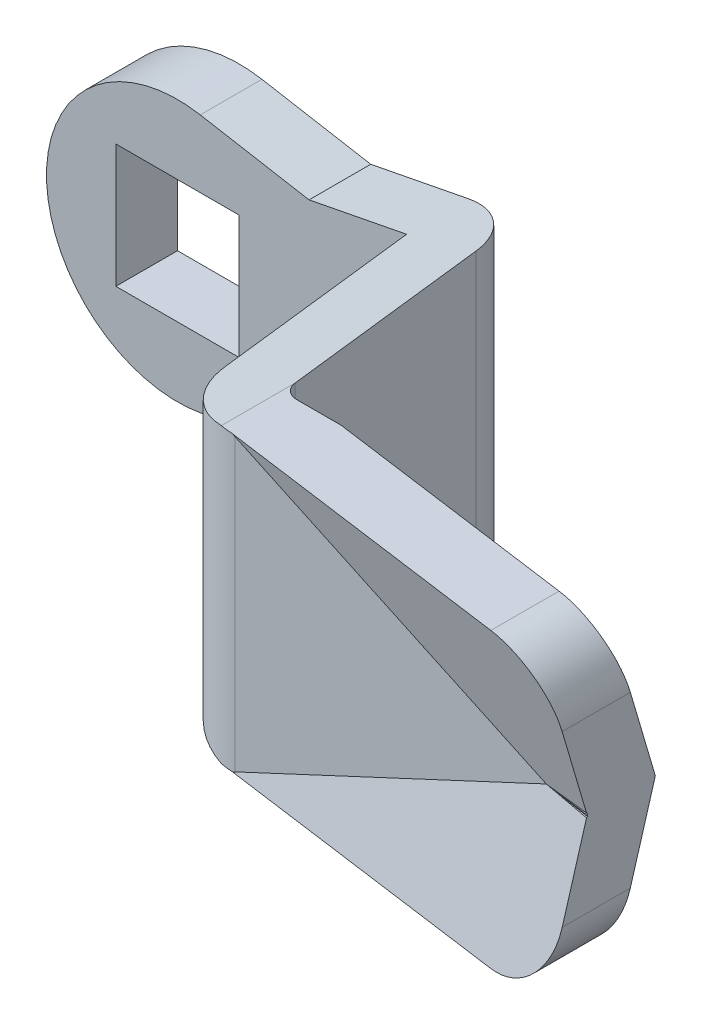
ISO-10303-21;
HEADER;
FILE_DESCRIPTION(('STEP AP214'),'2;1');
FILE_NAME('part.step','',(''),(''),'','','');
FILE_SCHEMA(('AUTOMOTIVE_DESIGN { 1 0 10303 214 1 1 1 1 }'));
ENDSEC;
DATA;
#1=APPLICATION_CONTEXT('core data for automotive mechanical design processes');
#2=APPLICATION_PROTOCOL_DEFINITION('international standard','automotive_design',2000,#1);
#3=PRODUCT_CONTEXT('',#1,'mechanical');
#4=PRODUCT('Part','Part','',(#3));
#5=PRODUCT_RELATED_PRODUCT_CATEGORY('part','',(#4));
#6=PRODUCT_DEFINITION_FORMATION('','',#4);
#7=PRODUCT_DEFINITION_CONTEXT('part definition',#1,'design');
#8=PRODUCT_DEFINITION('design','',#6,#7);
#9=PRODUCT_DEFINITION_SHAPE('','',#8);
#10=(LENGTH_UNIT() NAMED_UNIT(*) SI_UNIT(.MILLI.,.METRE.));
#11=(NAMED_UNIT(*) PLANE_ANGLE_UNIT() SI_UNIT($,.RADIAN.));
#12=(NAMED_UNIT(*) SI_UNIT($,.STERADIAN.) SOLID_ANGLE_UNIT());
#13=UNCERTAINTY_MEASURE_WITH_UNIT(LENGTH_MEASURE(1.E-05),#10,'distance_accuracy_value','');
#14=(GEOMETRIC_REPRESENTATION_CONTEXT(3) GLOBAL_UNCERTAINTY_ASSIGNED_CONTEXT((#13)) GLOBAL_UNIT_ASSIGNED_CONTEXT((#10,
#11,#12)) REPRESENTATION_CONTEXT('',''));
#15=CARTESIAN_POINT('',(0.,0.,0.));
#16=DIRECTION('',(0.,0.,1.));
#17=DIRECTION('',(1.,0.,0.));
#18=AXIS2_PLACEMENT_3D('',#15,#16,#17);
#19=CARTESIAN_POINT('',(49.9633750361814,-17.238998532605,28.1803398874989));
#20=DIRECTION('',(0.130596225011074,-0.280064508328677,-0.951056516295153));
#21=DIRECTION('',(0.,-0.959272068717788,0.282483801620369));
#22=AXIS2_PLACEMENT_3D('',#19,#20,#21);
#23=PLANE('',#22);
#24=DIRECTION('',(-0.990703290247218,0.,-0.13604040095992));
#25=VECTOR('',#24,1.);
#26=CARTESIAN_POINT('',(50.2705232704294,-9.5,25.9435575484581));
#27=LINE('',#26,#25);
#28=CARTESIAN_POINT('',(41.,-9.5,24.6705571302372));
#29=VERTEX_POINT('',#28);
#30=CARTESIAN_POINT('',(21.7800364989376,-9.5,22.0313294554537));
#31=VERTEX_POINT('',#30);
#32=EDGE_CURVE('E392',#29,#31,#27,.T.);
#33=ORIENTED_EDGE('',*,*,#32,.F.);
#34=CARTESIAN_POINT('',(41.,-5.5,23.4926481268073));
#35=DIRECTION('',(0.130596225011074,-0.280064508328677,-0.951056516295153));
#36=DIRECTION('',(0.401933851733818,-0.861949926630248,0.309016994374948));
#37=AXIS2_PLACEMENT_3D('',#34,#35,#36);
#38=ELLIPSE('',#37,4.20584889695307,4.);
#39=CARTESIAN_POINT('',(45.,-5.5,24.0419161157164));
#40=VERTEX_POINT('',#39);
#41=EDGE_CURVE('E9',#29,#40,#38,.F.);
#42=ORIENTED_EDGE('',*,*,#41,.T.);
#43=DIRECTION('',(0.,0.959272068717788,-0.28248380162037));
#44=VECTOR('',#43,1.);
#45=CARTESIAN_POINT('',(45.,-17.4236857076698,27.5531703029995));
#46=LINE('',#45,#44);
#47=CARTESIAN_POINT('',(45.,-0.136162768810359,22.4623880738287));
#48=VERTEX_POINT('',#47);
#49=EDGE_CURVE('E378',#40,#48,#46,.T.);
#50=ORIENTED_EDGE('',*,*,#49,.T.);
#51=DIRECTION('',(0.987938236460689,-0.0437421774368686,0.148541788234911));
#52=VECTOR('',#51,1.);
#53=CARTESIAN_POINT('',(51.4225647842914,-0.420529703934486,23.4280549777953));
#54=LINE('',#53,#52);
#55=CARTESIAN_POINT('',(41.924698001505,0.,22.));
#56=VERTEX_POINT('',#55);
#57=EDGE_CURVE('E224',#56,#48,#54,.T.);
#58=ORIENTED_EDGE('',*,*,#57,.F.);
#59=DIRECTION('',(0.906307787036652,0.422618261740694,0.));
#60=VECTOR('',#59,1.);
#61=CARTESIAN_POINT('',(40.8120209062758,-0.518849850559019,22.));
#62=LINE('',#61,#60);
#63=CARTESIAN_POINT('',(21.7392867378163,-9.4126118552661,22.));
#64=VERTEX_POINT('',#63);
#65=EDGE_CURVE('E451',#56,#64,#62,.F.);
#66=ORIENTED_EDGE('',*,*,#65,.T.);
#67=DIRECTION('',(-0.401933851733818,0.861949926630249,-0.309016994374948));
#68=VECTOR('',#67,1.);
#69=CARTESIAN_POINT('',(29.7779637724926,-26.651610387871,28.1803398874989));
#70=LINE('',#69,#68);
#71=EDGE_CURVE('E432',#31,#64,#70,.T.);
#72=ORIENTED_EDGE('',*,*,#71,.F.);
#73=EDGE_LOOP('',(#33,#42,#50,#58,#66,#72));
#74=FACE_BOUND('',#73,.T.);
#75=ADVANCED_FACE('F14',(#74),#23,.F.);
#76=CARTESIAN_POINT('',(45.,-40.,40.));
#77=DIRECTION('',(-1.,0.,0.));
#78=DIRECTION('',(0.,1.,0.));
#79=AXIS2_PLACEMENT_3D('',#76,#77,#78);
#80=PLANE('',#79);
#81=DIRECTION('',(0.,-0.959272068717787,-0.28248380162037));
#82=VECTOR('',#81,1.);
#83=CARTESIAN_POINT('',(45.,11.3997764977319,21.3569748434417));
#84=LINE('',#83,#82);
#85=CARTESIAN_POINT('',(45.,5.5,19.6196248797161));
#86=VERTEX_POINT('',#85);
#87=CARTESIAN_POINT('',(45.,0.,18.));
#88=VERTEX_POINT('',#87);
#89=EDGE_CURVE('E380',#86,#88,#84,.T.);
#90=ORIENTED_EDGE('',*,*,#89,.F.);
#91=DIRECTION('',(0.,0.,-1.));
#92=VECTOR('',#91,1.);
#93=CARTESIAN_POINT('',(45.,5.5,40.));
#94=LINE('',#93,#92);
#95=CARTESIAN_POINT('',(45.,5.5,24.0419161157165));
#96=VERTEX_POINT('',#95);
#97=EDGE_CURVE('E547',#86,#96,#94,.F.);
#98=ORIENTED_EDGE('',*,*,#97,.T.);
#99=DIRECTION('',(0.,0.959272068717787,0.282483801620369));
#100=VECTOR('',#99,1.);
#101=CARTESIAN_POINT('',(45.,19.9468572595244,28.2961869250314));
#102=LINE('',#101,#100);
#103=CARTESIAN_POINT('',(45.,0.13616276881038,22.4623880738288));
#104=VERTEX_POINT('',#103);
#105=EDGE_CURVE('E375',#104,#96,#102,.T.);
#106=ORIENTED_EDGE('',*,*,#105,.F.);
#107=DIRECTION('',(0.,-0.28248380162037,-0.959272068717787));
#108=VECTOR('',#107,1.);
#109=CARTESIAN_POINT('',(45.,1.6857348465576,27.7244994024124));
#110=LINE('',#109,#108);
#111=CARTESIAN_POINT('',(45.,0.114431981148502,22.3885936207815));
#112=VERTEX_POINT('',#111);
#113=EDGE_CURVE('E533',#104,#112,#110,.T.);
#114=ORIENTED_EDGE('',*,*,#113,.T.);
#115=CARTESIAN_POINT('',(45.,0.,22.4222912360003));
#116=VERTEX_POINT('',#115);
#117=EDGE_CURVE('E240',#116,#112,#46,.T.);
#118=ORIENTED_EDGE('',*,*,#117,.F.);
#119=DIRECTION('',(0.,-0.959272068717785,-0.282483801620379));
#120=VECTOR('',#119,1.);
#121=CARTESIAN_POINT('',(45.,-32.0449292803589,12.985788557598));
#122=LINE('',#121,#120);
#123=CARTESIAN_POINT('',(45.,-0.114431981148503,22.3885936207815));
#124=VERTEX_POINT('',#123);
#125=EDGE_CURVE('E232',#116,#124,#122,.T.);
#126=ORIENTED_EDGE('',*,*,#125,.T.);
#127=DIRECTION('',(0.,0.282483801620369,-0.959272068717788));
#128=VECTOR('',#127,1.);
#129=CARTESIAN_POINT('',(45.,-8.0695027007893,49.4028050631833));
#130=LINE('',#129,#128);
#131=EDGE_CURVE('E218',#48,#124,#130,.T.);
#132=ORIENTED_EDGE('',*,*,#131,.F.);
#133=ORIENTED_EDGE('',*,*,#49,.F.);
#134=DIRECTION('',(0.,0.,-1.));
#135=VECTOR('',#134,1.);
#136=CARTESIAN_POINT('',(45.,-5.5,40.));
#137=LINE('',#136,#135);
#138=CARTESIAN_POINT('',(45.,-5.5,19.6196248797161));
#139=VERTEX_POINT('',#138);
#140=EDGE_CURVE('E544',#40,#139,#137,.T.);
#141=ORIENTED_EDGE('',*,*,#140,.T.);
#142=DIRECTION('',(0.,-0.959272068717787,0.28248380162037));
#143=VECTOR('',#142,1.);
#144=CARTESIAN_POINT('',(45.,-26.2800452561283,25.7388754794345));
#145=LINE('',#144,#143);
#146=EDGE_CURVE('E382',#88,#139,#145,.T.);
#147=ORIENTED_EDGE('',*,*,#146,.F.);
#148=EDGE_LOOP('',(#90,#98,#106,#114,#118,#126,#132,#133,#141,#147));
#149=FACE_BOUND('',#148,.T.);
#150=ADVANCED_FACE('F238',(#149),#80,.F.);
#151=CARTESIAN_POINT('',(10.5,-2.8,-2.4));
#152=DIRECTION('',(1.,0.,0.));
#153=DIRECTION('',(0.,0.,1.));
#154=AXIS2_PLACEMENT_3D('',#151,#152,#153);
#155=PLANE('',#154);
#156=DIRECTION('',(0.,0.,1.));
#157=VECTOR('',#156,1.);
#158=CARTESIAN_POINT('',(10.5,-2.8,-2.4));
#159=LINE('',#158,#157);
#160=CARTESIAN_POINT('',(10.5,-2.8,-0.400000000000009));
#161=VERTEX_POINT('',#160);
#162=CARTESIAN_POINT('',(10.5,-2.8,0.));
#163=VERTEX_POINT('',#162);
#164=EDGE_CURVE('E285',#161,#163,#159,.T.);
#165=ORIENTED_EDGE('',*,*,#164,.F.);
#166=DIRECTION('',(0.,-1.,0.));
#167=VECTOR('',#166,1.);
#168=CARTESIAN_POINT('',(10.5,9.5,-0.400000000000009));
#169=LINE('',#168,#167);
#170=CARTESIAN_POINT('',(10.5,2.8,-0.400000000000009));
#171=VERTEX_POINT('',#170);
#172=EDGE_CURVE('E251',#171,#161,#169,.T.);
#173=ORIENTED_EDGE('',*,*,#172,.F.);
#174=DIRECTION('',(0.,0.,1.));
#175=VECTOR('',#174,1.);
#176=CARTESIAN_POINT('',(10.5,2.8,-2.4));
#177=LINE('',#176,#175);
#178=CARTESIAN_POINT('',(10.5,2.8,0.));
#179=VERTEX_POINT('',#178);
#180=EDGE_CURVE('E277',#171,#179,#177,.T.);
#181=ORIENTED_EDGE('',*,*,#180,.T.);
#182=DIRECTION('',(0.,1.,0.));
#183=VECTOR('',#182,1.);
#184=CARTESIAN_POINT('',(10.5,-2.8,0.));
#185=LINE('',#184,#183);
#186=EDGE_CURVE('E258',#163,#179,#185,.T.);
#187=ORIENTED_EDGE('',*,*,#186,.F.);
#188=EDGE_LOOP('',(#165,#173,#181,#187));
#189=FACE_BOUND('',#188,.T.);
#190=ADVANCED_FACE('F584',(#189),#155,.T.);
#191=CARTESIAN_POINT('',(10.5,-2.8,-2.4));
#192=DIRECTION('',(0.,1.,0.));
#193=DIRECTION('',(1.,0.,0.));
#194=AXIS2_PLACEMENT_3D('',#191,#192,#193);
#195=PLANE('',#194);
#196=DIRECTION('',(0.707106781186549,0.,0.707106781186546));
#197=VECTOR('',#196,1.);
#198=CARTESIAN_POINT('',(8.5,-2.8,-2.4));
#199=LINE('',#198,#197);
#200=CARTESIAN_POINT('',(8.5,-2.8,-2.4));
#201=VERTEX_POINT('',#200);
#202=EDGE_CURVE('E248',#201,#161,#199,.T.);
#203=ORIENTED_EDGE('',*,*,#202,.T.);
#204=ORIENTED_EDGE('',*,*,#164,.T.);
#205=DIRECTION('',(-1.,0.,0.));
#206=VECTOR('',#205,1.);
#207=CARTESIAN_POINT('',(10.5,-2.8,0.));
#208=LINE('',#207,#206);
#209=CARTESIAN_POINT('',(6.5,-2.8,0.));
#210=VERTEX_POINT('',#209);
#211=EDGE_CURVE('E266',#163,#210,#208,.T.);
#212=ORIENTED_EDGE('',*,*,#211,.T.);
#213=DIRECTION('',(0.,0.,1.));
#214=VECTOR('',#213,1.);
#215=CARTESIAN_POINT('',(6.5,-2.8,-2.4));
#216=LINE('',#215,#214);
#217=CARTESIAN_POINT('',(6.5,-2.8,-2.4));
#218=VERTEX_POINT('',#217);
#219=EDGE_CURVE('E282',#218,#210,#216,.T.);
#220=ORIENTED_EDGE('',*,*,#219,.F.);
#221=DIRECTION('',(-1.,0.,0.));
#222=VECTOR('',#221,1.);
#223=CARTESIAN_POINT('',(10.5,-2.8,-2.4));
#224=LINE('',#223,#222);
#225=EDGE_CURVE('E275',#201,#218,#224,.T.);
#226=ORIENTED_EDGE('',*,*,#225,.F.);
#227=EDGE_LOOP('',(#203,#204,#212,#220,#226));
#228=FACE_BOUND('',#227,.T.);
#229=ADVANCED_FACE('F818',(#228),#195,.F.);
#230=CARTESIAN_POINT('',(6.5,2.8,-2.4));
#231=DIRECTION('',(0.,-1.,0.));
#232=DIRECTION('',(-1.,0.,0.));
#233=AXIS2_PLACEMENT_3D('',#230,#231,#232);
#234=PLANE('',#233);
#235=DIRECTION('',(0.707106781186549,0.,0.707106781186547));
#236=VECTOR('',#235,1.);
#237=CARTESIAN_POINT('',(7.5,2.8,-3.4));
#238=LINE('',#237,#236);
#239=CARTESIAN_POINT('',(8.5,2.8,-2.4));
#240=VERTEX_POINT('',#239);
#241=EDGE_CURVE('E256',#240,#171,#238,.T.);
#242=ORIENTED_EDGE('',*,*,#241,.F.);
#243=DIRECTION('',(1.,0.,0.));
#244=VECTOR('',#243,1.);
#245=CARTESIAN_POINT('',(6.5,2.8,-2.4));
#246=LINE('',#245,#244);
#247=CARTESIAN_POINT('',(6.5,2.8,-2.4));
#248=VERTEX_POINT('',#247);
#249=EDGE_CURVE('E269',#248,#240,#246,.T.);
#250=ORIENTED_EDGE('',*,*,#249,.F.);
#251=DIRECTION('',(0.,0.,1.));
#252=VECTOR('',#251,1.);
#253=CARTESIAN_POINT('',(6.5,2.8,-2.4));
#254=LINE('',#253,#252);
#255=CARTESIAN_POINT('',(6.5,2.8,0.));
#256=VERTEX_POINT('',#255);
#257=EDGE_CURVE('E279',#248,#256,#254,.T.);
#258=ORIENTED_EDGE('',*,*,#257,.T.);
#259=DIRECTION('',(1.,0.,0.));
#260=VECTOR('',#259,1.);
#261=CARTESIAN_POINT('',(6.5,2.8,0.));
#262=LINE('',#261,#260);
#263=EDGE_CURVE('E261',#256,#179,#262,.T.);
#264=ORIENTED_EDGE('',*,*,#263,.T.);
#265=ORIENTED_EDGE('',*,*,#180,.F.);
#266=EDGE_LOOP('',(#242,#250,#258,#264,#265));
#267=FACE_BOUND('',#266,.T.);
#268=ADVANCED_FACE('F810',(#267),#234,.F.);
#269=CARTESIAN_POINT('',(10.5,2.8,-2.4));
#270=DIRECTION('',(0.,0.,-1.));
#271=DIRECTION('',(1.,0.,0.));
#272=AXIS2_PLACEMENT_3D('',#269,#270,#271);
#273=PLANE('',#272);
#274=ORIENTED_EDGE('',*,*,#249,.T.);
#275=DIRECTION('',(0.,-1.,0.));
#276=VECTOR('',#275,1.);
#277=CARTESIAN_POINT('',(8.5,9.5,-2.4));
#278=LINE('',#277,#276);
#279=EDGE_CURVE('E253',#240,#201,#278,.T.);
#280=ORIENTED_EDGE('',*,*,#279,.T.);
#281=ORIENTED_EDGE('',*,*,#225,.T.);
#282=DIRECTION('',(0.,-1.,0.));
#283=VECTOR('',#282,1.);
#284=CARTESIAN_POINT('',(6.5,2.8,-2.4));
#285=LINE('',#284,#283);
#286=EDGE_CURVE('E272',#248,#218,#285,.T.);
#287=ORIENTED_EDGE('',*,*,#286,.F.);
#288=EDGE_LOOP('',(#274,#280,#281,#287));
#289=FACE_BOUND('',#288,.T.);
#290=ADVANCED_FACE('F670',(#289),#273,.T.);
#291=CARTESIAN_POINT('',(14.8631180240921,-9.5,0.));
#292=DIRECTION('',(0.,0.,-1.));
#293=DIRECTION('',(1.,0.,0.));
#294=AXIS2_PLACEMENT_3D('',#291,#292,#293);
#295=PLANE('',#294);
#296=DIRECTION('',(0.,1.,0.));
#297=VECTOR('',#296,1.);
#298=CARTESIAN_POINT('',(14.8631180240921,-9.5,0.));
#299=LINE('',#298,#297);
#300=CARTESIAN_POINT('',(14.8631180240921,-8.35589681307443,0.));
#301=VERTEX_POINT('',#300);
#302=CARTESIAN_POINT('',(14.8631180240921,8.35589681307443,0.));
#303=VERTEX_POINT('',#302);
#304=EDGE_CURVE('E479',#301,#303,#299,.T.);
#305=ORIENTED_EDGE('',*,*,#304,.F.);
#306=DIRECTION('',(-0.981627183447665,0.190808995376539,0.));
#307=VECTOR('',#306,1.);
#308=CARTESIAN_POINT('',(15.0774123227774,-8.39755140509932,0.));
#309=LINE('',#308,#307);
#310=CARTESIAN_POINT('',(8.53591755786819,-7.12601363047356,0.));
#311=VERTEX_POINT('',#310);
#312=EDGE_CURVE('E325',#301,#311,#309,.T.);
#313=ORIENTED_EDGE('',*,*,#312,.T.);
#314=DIRECTION('',(0.984807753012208,0.173648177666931,0.));
#315=VECTOR('',#314,1.);
#316=CARTESIAN_POINT('',(14.2663540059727,-6.11558307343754,0.));
#317=LINE('',#316,#315);
#318=CARTESIAN_POINT('',(1.47600951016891,-8.37086590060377,0.));
#319=VERTEX_POINT('',#318);
#320=EDGE_CURVE('E531',#319,#311,#317,.T.);
#321=ORIENTED_EDGE('',*,*,#320,.F.);
#322=CARTESIAN_POINT('',(0.,0.,0.));
#323=DIRECTION('',(0.,0.,-1.));
#324=DIRECTION('',(1.,0.,0.));
#325=AXIS2_PLACEMENT_3D('',#322,#323,#324);
#326=CIRCLE('',#325,8.5);
#327=CARTESIAN_POINT('',(1.47600951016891,8.37086590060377,0.));
#328=VERTEX_POINT('',#327);
#329=EDGE_CURVE('E334',#319,#328,#326,.T.);
#330=ORIENTED_EDGE('',*,*,#329,.T.);
#331=DIRECTION('',(0.984807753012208,-0.173648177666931,0.));
#332=VECTOR('',#331,1.);
#333=CARTESIAN_POINT('',(17.5155453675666,5.54266297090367,0.));
#334=LINE('',#333,#332);
#335=CARTESIAN_POINT('',(8.53591755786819,7.12601363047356,0.));
#336=VERTEX_POINT('',#335);
#337=EDGE_CURVE('E534',#328,#336,#334,.T.);
#338=ORIENTED_EDGE('',*,*,#337,.T.);
#339=DIRECTION('',(-0.981627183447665,-0.190808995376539,0.));
#340=VECTOR('',#339,1.);
#341=CARTESIAN_POINT('',(11.5186496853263,7.70579802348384,0.));
#342=LINE('',#341,#340);
#343=EDGE_CURVE('E308',#303,#336,#342,.T.);
#344=ORIENTED_EDGE('',*,*,#343,.F.);
#345=EDGE_LOOP('',(#305,#313,#321,#330,#338,#344));
#346=FACE_BOUND('',#345,.T.);
#347=DIRECTION('',(1.,0.,0.));
#348=VECTOR('',#347,1.);
#349=CARTESIAN_POINT('',(-4.,4.,0.));
#350=LINE('',#349,#348);
#351=CARTESIAN_POINT('',(-4.,4.,0.));
#352=VERTEX_POINT('',#351);
#353=CARTESIAN_POINT('',(4.,4.,0.));
#354=VERTEX_POINT('',#353);
#355=EDGE_CURVE('E352',#352,#354,#350,.T.);
#356=ORIENTED_EDGE('',*,*,#355,.F.);
#357=DIRECTION('',(0.,-1.,0.));
#358=VECTOR('',#357,1.);
#359=CARTESIAN_POINT('',(-4.,4.,0.));
#360=LINE('',#359,#358);
#361=CARTESIAN_POINT('',(-4.,-4.,0.));
#362=VERTEX_POINT('',#361);
#363=EDGE_CURVE('E343',#352,#362,#360,.T.);
#364=ORIENTED_EDGE('',*,*,#363,.T.);
#365=DIRECTION('',(-1.,0.,0.));
#366=VECTOR('',#365,1.);
#367=CARTESIAN_POINT('',(4.,-4.,0.));
#368=LINE('',#367,#366);
#369=CARTESIAN_POINT('',(4.,-4.,0.));
#370=VERTEX_POINT('',#369);
#371=EDGE_CURVE('E346',#370,#362,#368,.T.);
#372=ORIENTED_EDGE('',*,*,#371,.F.);
#373=DIRECTION('',(0.,1.,0.));
#374=VECTOR('',#373,1.);
#375=CARTESIAN_POINT('',(4.,-4.,0.));
#376=LINE('',#375,#374);
#377=EDGE_CURVE('E349',#370,#354,#376,.T.);
#378=ORIENTED_EDGE('',*,*,#377,.T.);
#379=EDGE_LOOP('',(#356,#364,#372,#378));
#380=FACE_BOUND('',#379,.T.);
#381=ORIENTED_EDGE('',*,*,#211,.F.);
#382=ORIENTED_EDGE('',*,*,#186,.T.);
#383=ORIENTED_EDGE('',*,*,#263,.F.);
#384=DIRECTION('',(0.,-1.,0.));
#385=VECTOR('',#384,1.);
#386=CARTESIAN_POINT('',(6.5,2.8,0.));
#387=LINE('',#386,#385);
#388=EDGE_CURVE('E264',#256,#210,#387,.T.);
#389=ORIENTED_EDGE('',*,*,#388,.T.);
#390=EDGE_LOOP('',(#381,#382,#383,#389));
#391=FACE_BOUND('',#390,.T.);
#392=ADVANCED_FACE('F616',(#346,#380,#391),#295,.T.);
#393=CARTESIAN_POINT('',(14.8631180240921,-9.5,4.));
#394=DIRECTION('',(0.,0.,-1.));
#395=DIRECTION('',(1.,0.,0.));
#396=AXIS2_PLACEMENT_3D('',#393,#394,#395);
#397=PLANE('',#396);
#398=DIRECTION('',(0.,-1.,0.));
#399=VECTOR('',#398,1.);
#400=CARTESIAN_POINT('',(-4.,-9.5,4.));
#401=LINE('',#400,#399);
#402=CARTESIAN_POINT('',(-4.,4.,4.));
#403=VERTEX_POINT('',#402);
#404=CARTESIAN_POINT('',(-4.,-4.,4.));
#405=VERTEX_POINT('',#404);
#406=EDGE_CURVE('E373',#403,#405,#401,.T.);
#407=ORIENTED_EDGE('',*,*,#406,.F.);
#408=DIRECTION('',(1.,0.,0.));
#409=VECTOR('',#408,1.);
#410=CARTESIAN_POINT('',(14.8631180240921,4.,4.));
#411=LINE('',#410,#409);
#412=CARTESIAN_POINT('',(4.,4.,4.));
#413=VERTEX_POINT('',#412);
#414=EDGE_CURVE('E364',#403,#413,#411,.T.);
#415=ORIENTED_EDGE('',*,*,#414,.T.);
#416=DIRECTION('',(0.,1.,0.));
#417=VECTOR('',#416,1.);
#418=CARTESIAN_POINT('',(4.,-9.5,4.));
#419=LINE('',#418,#417);
#420=CARTESIAN_POINT('',(4.,-4.,4.));
#421=VERTEX_POINT('',#420);
#422=EDGE_CURVE('E367',#421,#413,#419,.T.);
#423=ORIENTED_EDGE('',*,*,#422,.F.);
#424=DIRECTION('',(-1.,0.,0.));
#425=VECTOR('',#424,1.);
#426=CARTESIAN_POINT('',(14.8631180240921,-4.,4.));
#427=LINE('',#426,#425);
#428=EDGE_CURVE('E370',#421,#405,#427,.T.);
#429=ORIENTED_EDGE('',*,*,#428,.T.);
#430=EDGE_LOOP('',(#407,#415,#423,#429));
#431=FACE_BOUND('',#430,.T.);
#432=DIRECTION('',(-0.981627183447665,0.190808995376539,0.));
#433=VECTOR('',#432,1.);
#434=CARTESIAN_POINT('',(15.0774123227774,-8.39755140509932,4.));
#435=LINE('',#434,#433);
#436=CARTESIAN_POINT('',(14.8631180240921,-8.35589681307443,4.));
#437=VERTEX_POINT('',#436);
#438=CARTESIAN_POINT('',(8.53591755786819,-7.12601363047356,4.));
#439=VERTEX_POINT('',#438);
#440=EDGE_CURVE('E332',#437,#439,#435,.T.);
#441=ORIENTED_EDGE('',*,*,#440,.F.);
#442=DIRECTION('',(0.,1.,0.));
#443=VECTOR('',#442,1.);
#444=CARTESIAN_POINT('',(14.8631180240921,-9.5,4.));
#445=LINE('',#444,#443);
#446=CARTESIAN_POINT('',(14.8631180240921,8.35589681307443,4.));
#447=VERTEX_POINT('',#446);
#448=EDGE_CURVE('E482',#437,#447,#445,.T.);
#449=ORIENTED_EDGE('',*,*,#448,.T.);
#450=DIRECTION('',(-0.981627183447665,-0.190808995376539,0.));
#451=VECTOR('',#450,1.);
#452=CARTESIAN_POINT('',(11.5186496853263,7.70579802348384,4.));
#453=LINE('',#452,#451);
#454=CARTESIAN_POINT('',(8.53591755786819,7.12601363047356,4.));
#455=VERTEX_POINT('',#454);
#456=EDGE_CURVE('E316',#447,#455,#453,.T.);
#457=ORIENTED_EDGE('',*,*,#456,.T.);
#458=DIRECTION('',(0.984807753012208,-0.173648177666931,0.));
#459=VECTOR('',#458,1.);
#460=CARTESIAN_POINT('',(17.5155453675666,5.54266297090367,4.));
#461=LINE('',#460,#459);
#462=CARTESIAN_POINT('',(1.47600951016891,8.37086590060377,4.));
#463=VERTEX_POINT('',#462);
#464=EDGE_CURVE('E338',#463,#455,#461,.T.);
#465=ORIENTED_EDGE('',*,*,#464,.F.);
#466=CARTESIAN_POINT('',(0.,0.,4.));
#467=DIRECTION('',(0.,0.,-1.));
#468=DIRECTION('',(1.,0.,0.));
#469=AXIS2_PLACEMENT_3D('',#466,#467,#468);
#470=CIRCLE('',#469,8.5);
#471=CARTESIAN_POINT('',(1.47600951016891,-8.37086590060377,4.));
#472=VERTEX_POINT('',#471);
#473=EDGE_CURVE('E336',#472,#463,#470,.T.);
#474=ORIENTED_EDGE('',*,*,#473,.F.);
#475=DIRECTION('',(0.984807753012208,0.173648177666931,0.));
#476=VECTOR('',#475,1.);
#477=CARTESIAN_POINT('',(14.2663540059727,-6.11558307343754,4.));
#478=LINE('',#477,#476);
#479=EDGE_CURVE('E340',#472,#439,#478,.T.);
#480=ORIENTED_EDGE('',*,*,#479,.T.);
#481=EDGE_LOOP('',(#441,#449,#457,#465,#474,#480));
#482=FACE_BOUND('',#481,.T.);
#483=ADVANCED_FACE('F521',(#431,#482),#397,.F.);
#484=CARTESIAN_POINT('',(21.7392867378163,-9.5,17.));
#485=DIRECTION('',(0.,1.,0.));
#486=DIRECTION('',(1.,0.,0.));
#487=AXIS2_PLACEMENT_3D('',#484,#485,#486);
#488=CYLINDRICAL_SURFACE('',#487,5.);
#489=CARTESIAN_POINT('',(21.7392867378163,-9.69248861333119,17.));
#490=DIRECTION('',(-0.190808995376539,-0.981627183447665,0.));
#491=DIRECTION('',(-0.981627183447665,0.190808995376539,0.));
#492=AXIS2_PLACEMENT_3D('',#489,#490,#491);
#493=ELLIPSE('',#492,5.09358347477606,5.);
#494=CARTESIAN_POINT('',(20.7490186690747,-9.5,21.9009559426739));
#495=VERTEX_POINT('',#494);
#496=CARTESIAN_POINT('',(16.7879463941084,-8.73004554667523,17.6958655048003));
#497=VERTEX_POINT('',#496);
#498=EDGE_CURVE('E330',#495,#497,#493,.T.);
#499=ORIENTED_EDGE('',*,*,#498,.F.);
#500=CARTESIAN_POINT('',(21.7392867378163,-9.5,17.));
#501=DIRECTION('',(0.,-1.,0.));
#502=DIRECTION('',(-1.,0.,0.));
#503=AXIS2_PLACEMENT_3D('',#500,#501,#502);
#504=CIRCLE('',#503,5.);
#505=CARTESIAN_POINT('',(21.5545081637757,-9.5,21.9965845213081));
#506=VERTEX_POINT('',#505);
#507=EDGE_CURVE('E467',#506,#495,#504,.T.);
#508=ORIENTED_EDGE('',*,*,#507,.F.);
#509=CARTESIAN_POINT('',(21.7392867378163,-11.205157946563,17.));
#510=DIRECTION('',(-0.401933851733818,0.861949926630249,-0.309016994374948));
#511=DIRECTION('',(0.683336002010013,0.506993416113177,0.52536614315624));
#512=AXIS2_PLACEMENT_3D('',#509,#510,#511);
#513=ELLIPSE('',#512,5.80080100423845,5.);
#514=EDGE_CURVE('E448',#64,#506,#513,.F.);
#515=ORIENTED_EDGE('',*,*,#514,.F.);
#516=DIRECTION('',(0.,1.,0.));
#517=VECTOR('',#516,1.);
#518=CARTESIAN_POINT('',(21.7392867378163,-9.5,22.));
#519=LINE('',#518,#517);
#520=CARTESIAN_POINT('',(21.7392867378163,9.4126118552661,22.));
#521=VERTEX_POINT('',#520);
#522=EDGE_CURVE('E416',#64,#521,#519,.T.);
#523=ORIENTED_EDGE('',*,*,#522,.T.);
#524=CARTESIAN_POINT('',(21.7392867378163,11.205157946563,17.));
#525=DIRECTION('',(-0.401933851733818,-0.861949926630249,-0.309016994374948));
#526=DIRECTION('',(-0.683336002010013,0.506993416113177,-0.52536614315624));
#527=AXIS2_PLACEMENT_3D('',#524,#525,#526);
#528=ELLIPSE('',#527,5.80080100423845,5.);
#529=CARTESIAN_POINT('',(21.5545081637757,9.5,21.9965845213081));
#530=VERTEX_POINT('',#529);
#531=EDGE_CURVE('E442',#521,#530,#528,.T.);
#532=ORIENTED_EDGE('',*,*,#531,.T.);
#533=CARTESIAN_POINT('',(21.7392867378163,9.5,17.));
#534=DIRECTION('',(0.,-1.,0.));
#535=DIRECTION('',(-1.,0.,0.));
#536=AXIS2_PLACEMENT_3D('',#533,#534,#535);
#537=CIRCLE('',#536,5.);
#538=CARTESIAN_POINT('',(20.7490186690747,9.5,21.9009559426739));
#539=VERTEX_POINT('',#538);
#540=EDGE_CURVE('E459',#530,#539,#537,.T.);
#541=ORIENTED_EDGE('',*,*,#540,.T.);
#542=CARTESIAN_POINT('',(21.7392867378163,9.69248861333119,17.));
#543=DIRECTION('',(0.190808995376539,-0.981627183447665,0.));
#544=DIRECTION('',(0.981627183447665,0.190808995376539,0.));
#545=AXIS2_PLACEMENT_3D('',#542,#543,#544);
#546=ELLIPSE('',#545,5.09358347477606,5.);
#547=CARTESIAN_POINT('',(16.7879463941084,8.73004554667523,17.6958655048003));
#548=VERTEX_POINT('',#547);
#549=EDGE_CURVE('E313',#539,#548,#546,.T.);
#550=ORIENTED_EDGE('',*,*,#549,.T.);
#551=DIRECTION('',(0.,1.,0.));
#552=VECTOR('',#551,1.);
#553=CARTESIAN_POINT('',(16.7879463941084,-9.5,17.6958655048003));
#554=LINE('',#553,#552);
#555=EDGE_CURVE('E484',#497,#548,#554,.T.);
#556=ORIENTED_EDGE('',*,*,#555,.F.);
#557=EDGE_LOOP('',(#499,#508,#515,#523,#532,#541,#550,#556));
#558=FACE_BOUND('',#557,.T.);
#559=ADVANCED_FACE('F494',(#558),#488,.T.);
#560=CARTESIAN_POINT('',(21.7392867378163,-9.5,17.));
#561=DIRECTION('',(0.,-1.,0.));
#562=DIRECTION('',(-1.,0.,0.));
#563=AXIS2_PLACEMENT_3D('',#560,#561,#562);
#564=PLANE('',#563);
#565=DIRECTION('',(0.990703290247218,0.,0.13604040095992));
#566=VECTOR('',#565,1.);
#567=CARTESIAN_POINT('',(33.3500490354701,-9.5,19.1977975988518));
#568=LINE('',#567,#566);
#569=CARTESIAN_POINT('',(24.6271842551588,-9.5,18.));
#570=VERTEX_POINT('',#569);
#571=CARTESIAN_POINT('',(41.,-9.5,20.2482658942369));
#572=VERTEX_POINT('',#571);
#573=EDGE_CURVE('E415',#570,#572,#568,.T.);
#574=ORIENTED_EDGE('',*,*,#573,.T.);
#575=DIRECTION('',(0.,0.,-1.));
#576=VECTOR('',#575,1.);
#577=CARTESIAN_POINT('',(41.,-9.5,40.));
#578=LINE('',#577,#576);
#579=EDGE_CURVE('E22',#572,#29,#578,.F.);
#580=ORIENTED_EDGE('',*,*,#579,.T.);
#581=ORIENTED_EDGE('',*,*,#32,.T.);
#582=CARTESIAN_POINT('',(21.7800364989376,-9.5,22.0313294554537));
#583=CARTESIAN_POINT('',(21.7423539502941,-9.50000000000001,22.0261519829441));
#584=CARTESIAN_POINT('',(21.7047186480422,-9.50000000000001,22.0206678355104));
#585=CARTESIAN_POINT('',(21.6295425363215,-9.50000000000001,22.0090861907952));
#586=CARTESIAN_POINT('',(21.5920017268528,-9.50000000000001,22.0029886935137));
#587=CARTESIAN_POINT('',(21.5545081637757,-9.5,21.9965845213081));
#588=B_SPLINE_CURVE_WITH_KNOTS('',3,(#582,#583,#584,#585,#586,#587),.UNSPECIFIED.,.F.,.F.,(4,2,
4),(0.,0.114098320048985,0.228196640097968),.UNSPECIFIED.);
#589=EDGE_CURVE('E384',#31,#506,#588,.T.);
#590=ORIENTED_EDGE('',*,*,#589,.T.);
#591=ORIENTED_EDGE('',*,*,#507,.T.);
#592=DIRECTION('',(0.,0.,-1.));
#593=VECTOR('',#592,1.);
#594=CARTESIAN_POINT('',(20.7490186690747,-9.5,25.));
#595=LINE('',#594,#593);
#596=CARTESIAN_POINT('',(20.7490186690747,-9.5,17.1391731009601));
#597=VERTEX_POINT('',#596);
#598=EDGE_CURVE('E301',#495,#597,#595,.T.);
#599=ORIENTED_EDGE('',*,*,#598,.T.);
#600=CARTESIAN_POINT('',(21.7392867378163,-9.5,17.));
#601=DIRECTION('',(0.,-1.,0.));
#602=DIRECTION('',(-1.,0.,0.));
#603=AXIS2_PLACEMENT_3D('',#600,#601,#602);
#604=CIRCLE('',#603,1.);
#605=CARTESIAN_POINT('',(21.7392867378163,-9.5,18.));
#606=VERTEX_POINT('',#605);
#607=EDGE_CURVE('E464',#606,#597,#604,.T.);
#608=ORIENTED_EDGE('',*,*,#607,.F.);
#609=DIRECTION('',(-1.,0.,0.));
#610=VECTOR('',#609,1.);
#611=CARTESIAN_POINT('',(45.,-9.5,18.));
#612=LINE('',#611,#610);
#613=EDGE_CURVE('E462',#570,#606,#612,.T.);
#614=ORIENTED_EDGE('',*,*,#613,.F.);
#615=EDGE_LOOP('',(#574,#580,#581,#590,#591,#599,#608,#614));
#616=FACE_BOUND('',#615,.T.);
#617=ADVANCED_FACE('F561',(#616),#564,.T.);
#618=CARTESIAN_POINT('',(16.7879463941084,-9.5,17.6958655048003));
#619=DIRECTION('',(0.990268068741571,0.,-0.139173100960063));
#620=DIRECTION('',(0.139173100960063,0.,0.990268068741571));
#621=AXIS2_PLACEMENT_3D('',#618,#619,#620);
#622=PLANE('',#621);
#623=DIRECTION('',(-0.139122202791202,0.0270426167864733,-0.989905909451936));
#624=VECTOR('',#623,1.);
#625=CARTESIAN_POINT('',(16.7908431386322,-8.73060861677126,17.7164769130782));
#626=LINE('',#625,#624);
#627=EDGE_CURVE('E328',#497,#437,#626,.T.);
#628=ORIENTED_EDGE('',*,*,#627,.F.);
#629=ORIENTED_EDGE('',*,*,#555,.T.);
#630=DIRECTION('',(-0.139122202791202,-0.0270426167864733,-0.989905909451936));
#631=VECTOR('',#630,1.);
#632=CARTESIAN_POINT('',(16.7193607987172,8.71671385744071,17.2078536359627));
#633=LINE('',#632,#631);
#634=EDGE_CURVE('E310',#548,#447,#633,.T.);
#635=ORIENTED_EDGE('',*,*,#634,.T.);
#636=ORIENTED_EDGE('',*,*,#448,.F.);
#637=EDGE_LOOP('',(#628,#629,#635,#636));
#638=FACE_BOUND('',#637,.T.);
#639=ADVANCED_FACE('F518',(#638),#622,.F.);
#640=CARTESIAN_POINT('',(14.8631180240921,-9.5,4.));
#641=DIRECTION('',(0.,1.,0.));
#642=DIRECTION('',(1.,0.,0.));
#643=AXIS2_PLACEMENT_3D('',#640,#641,#642);
#644=CYLINDRICAL_SURFACE('',#643,4.);
#645=DIRECTION('',(0.,1.,0.));
#646=VECTOR('',#645,1.);
#647=CARTESIAN_POINT('',(18.8241902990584,-9.5,3.44330759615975));
#648=LINE('',#647,#646);
#649=CARTESIAN_POINT('',(18.8241902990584,-9.1258512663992,3.44330759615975));
#650=VERTEX_POINT('',#649);
#651=CARTESIAN_POINT('',(18.8241902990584,9.12585126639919,3.44330759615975));
#652=VERTEX_POINT('',#651);
#653=EDGE_CURVE('E476',#650,#652,#648,.T.);
#654=ORIENTED_EDGE('',*,*,#653,.F.);
#655=CARTESIAN_POINT('',(14.8631180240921,-8.35589681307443,4.));
#656=DIRECTION('',(-0.190808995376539,-0.981627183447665,0.));
#657=DIRECTION('',(-0.981627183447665,0.190808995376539,0.));
#658=AXIS2_PLACEMENT_3D('',#655,#656,#657);
#659=ELLIPSE('',#658,4.07486677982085,4.);
#660=EDGE_CURVE('E322',#650,#301,#659,.F.);
#661=ORIENTED_EDGE('',*,*,#660,.T.);
#662=ORIENTED_EDGE('',*,*,#304,.T.);
#663=CARTESIAN_POINT('',(14.8631180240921,8.35589681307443,4.));
#664=DIRECTION('',(0.190808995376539,-0.981627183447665,0.));
#665=DIRECTION('',(0.981627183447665,0.190808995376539,0.));
#666=AXIS2_PLACEMENT_3D('',#663,#664,#665);
#667=ELLIPSE('',#666,4.07486677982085,4.);
#668=EDGE_CURVE('E306',#652,#303,#667,.F.);
#669=ORIENTED_EDGE('',*,*,#668,.F.);
#670=EDGE_LOOP('',(#654,#661,#662,#669));
#671=FACE_BOUND('',#670,.T.);
#672=ADVANCED_FACE('F595',(#671),#644,.T.);
#673=CARTESIAN_POINT('',(20.7490186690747,-9.5,17.1391731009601));
#674=DIRECTION('',(0.990268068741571,0.,-0.139173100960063));
#675=DIRECTION('',(0.139173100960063,0.,0.990268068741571));
#676=AXIS2_PLACEMENT_3D('',#673,#674,#675);
#677=PLANE('',#676);
#678=DIRECTION('',(0.,1.,0.));
#679=VECTOR('',#678,1.);
#680=CARTESIAN_POINT('',(20.7490186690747,-9.5,17.1391731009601));
#681=LINE('',#680,#679);
#682=CARTESIAN_POINT('',(20.7490186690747,9.5,17.1391731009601));
#683=VERTEX_POINT('',#682);
#684=EDGE_CURVE('E473',#597,#683,#681,.T.);
#685=ORIENTED_EDGE('',*,*,#684,.F.);
#686=DIRECTION('',(-0.139122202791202,0.0270426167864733,-0.989905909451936));
#687=VECTOR('',#686,1.);
#688=CARTESIAN_POINT('',(20.7490186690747,-9.5,17.1391731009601));
#689=LINE('',#688,#687);
#690=EDGE_CURVE('E319',#597,#650,#689,.T.);
#691=ORIENTED_EDGE('',*,*,#690,.T.);
#692=ORIENTED_EDGE('',*,*,#653,.T.);
#693=DIRECTION('',(-0.139122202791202,-0.0270426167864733,-0.989905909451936));
#694=VECTOR('',#693,1.);
#695=CARTESIAN_POINT('',(20.6775363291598,9.48610524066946,16.6305498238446));
#696=LINE('',#695,#694);
#697=EDGE_CURVE('E304',#683,#652,#696,.T.);
#698=ORIENTED_EDGE('',*,*,#697,.F.);
#699=EDGE_LOOP('',(#685,#691,#692,#698));
#700=FACE_BOUND('',#699,.T.);
#701=ADVANCED_FACE('F587',(#700),#677,.T.);
#702=DIRECTION('',(0.991435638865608,0.0368913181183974,0.125277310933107));
#703=VECTOR('',#702,1.);
#704=CARTESIAN_POINT('',(41.924698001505,0.,22.));
#705=LINE('',#704,#703);
#706=EDGE_CURVE('E245',#56,#112,#705,.T.);
#707=ORIENTED_EDGE('',*,*,#706,.F.);
#708=DIRECTION('',(0.990703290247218,0.,0.136040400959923));
#709=VECTOR('',#708,1.);
#710=CARTESIAN_POINT('',(50.6475627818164,0.,23.1977975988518));
#711=LINE('',#710,#709);
#712=EDGE_CURVE('E228',#56,#116,#711,.T.);
#713=ORIENTED_EDGE('',*,*,#712,.T.);
#714=ORIENTED_EDGE('',*,*,#117,.T.);
#715=EDGE_LOOP('',(#707,#713,#714));
#716=FACE_BOUND('',#715,.T.);
#717=ADVANCED_FACE('F579',(#716),#23,.F.);
#718=CARTESIAN_POINT('',(29.7779637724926,-28.444156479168,23.1803398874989));
#719=DIRECTION('',(0.401933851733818,-0.861949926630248,0.309016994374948));
#720=DIRECTION('',(0.683336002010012,0.506993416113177,0.52536614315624));
#721=AXIS2_PLACEMENT_3D('',#718,#719,#720);
#722=ELLIPSE('',#721,5.80080100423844,5.);
#723=DIRECTION('',(-0.401933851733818,0.861949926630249,-0.309016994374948));
#724=VECTOR('',#723,1.);
#725=SURFACE_OF_LINEAR_EXTRUSION('',#722,#724);
#726=ORIENTED_EDGE('',*,*,#589,.F.);
#727=ORIENTED_EDGE('',*,*,#71,.T.);
#728=ORIENTED_EDGE('',*,*,#514,.T.);
#729=EDGE_LOOP('',(#726,#727,#728));
#730=FACE_BOUND('',#729,.T.);
#731=ADVANCED_FACE('F394',(#730),#725,.F.);
#732=CARTESIAN_POINT('',(32.6658612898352,-26.738998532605,24.1803398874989));
#733=DIRECTION('',(-0.130596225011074,0.280064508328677,0.951056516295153));
#734=DIRECTION('',(0.,0.959272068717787,-0.28248380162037));
#735=AXIS2_PLACEMENT_3D('',#732,#733,#734);
#736=PLANE('',#735);
#737=ORIENTED_EDGE('',*,*,#146,.T.);
#738=CARTESIAN_POINT('',(41.,-5.5,19.070356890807));
#739=DIRECTION('',(-0.130596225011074,0.280064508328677,0.951056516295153));
#740=DIRECTION('',(0.401933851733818,-0.861949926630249,0.309016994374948));
#741=AXIS2_PLACEMENT_3D('',#738,#739,#740);
#742=ELLIPSE('',#741,4.20584889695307,4.);
#743=EDGE_CURVE('E36',#139,#572,#742,.F.);
#744=ORIENTED_EDGE('',*,*,#743,.T.);
#745=ORIENTED_EDGE('',*,*,#573,.F.);
#746=DIRECTION('',(-0.906307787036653,-0.422618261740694,0.));
#747=VECTOR('',#746,1.);
#748=CARTESIAN_POINT('',(45.,0.,18.));
#749=LINE('',#748,#747);
#750=EDGE_CURVE('E439',#88,#570,#749,.T.);
#751=ORIENTED_EDGE('',*,*,#750,.F.);
#752=EDGE_LOOP('',(#737,#744,#745,#751));
#753=FACE_BOUND('',#752,.T.);
#754=ADVANCED_FACE('F594',(#753),#736,.F.);
#755=CARTESIAN_POINT('',(45.,-9.5,18.));
#756=DIRECTION('',(0.,0.,-1.));
#757=DIRECTION('',(0.,-1.,0.));
#758=AXIS2_PLACEMENT_3D('',#755,#756,#757);
#759=PLANE('',#758);
#760=DIRECTION('',(-0.906307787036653,0.422618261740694,0.));
#761=VECTOR('',#760,1.);
#762=CARTESIAN_POINT('',(45.,0.,18.));
#763=LINE('',#762,#761);
#764=CARTESIAN_POINT('',(24.6271842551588,9.5,18.));
#765=VERTEX_POINT('',#764);
#766=EDGE_CURVE('E436',#88,#765,#763,.T.);
#767=ORIENTED_EDGE('',*,*,#766,.F.);
#768=ORIENTED_EDGE('',*,*,#750,.T.);
#769=ORIENTED_EDGE('',*,*,#613,.T.);
#770=DIRECTION('',(0.,1.,0.));
#771=VECTOR('',#770,1.);
#772=CARTESIAN_POINT('',(21.7392867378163,-9.5,18.));
#773=LINE('',#772,#771);
#774=CARTESIAN_POINT('',(21.7392867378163,9.5,18.));
#775=VERTEX_POINT('',#774);
#776=EDGE_CURVE('E470',#606,#775,#773,.T.);
#777=ORIENTED_EDGE('',*,*,#776,.T.);
#778=DIRECTION('',(-1.,0.,0.));
#779=VECTOR('',#778,1.);
#780=CARTESIAN_POINT('',(45.,9.5,18.));
#781=LINE('',#780,#779);
#782=EDGE_CURVE('E454',#765,#775,#781,.T.);
#783=ORIENTED_EDGE('',*,*,#782,.F.);
#784=EDGE_LOOP('',(#767,#768,#769,#777,#783));
#785=FACE_BOUND('',#784,.T.);
#786=ADVANCED_FACE('F604',(#785),#759,.T.);
#787=CARTESIAN_POINT('',(45.,-9.5,22.));
#788=DIRECTION('',(0.,0.,-1.));
#789=DIRECTION('',(0.,-1.,0.));
#790=AXIS2_PLACEMENT_3D('',#787,#788,#789);
#791=PLANE('',#790);
#792=ORIENTED_EDGE('',*,*,#65,.F.);
#793=DIRECTION('',(-0.906307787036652,0.422618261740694,0.));
#794=VECTOR('',#793,1.);
#795=CARTESIAN_POINT('',(48.089443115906,-2.87466785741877,22.));
#796=LINE('',#795,#794);
#797=EDGE_CURVE('E445',#56,#521,#796,.T.);
#798=ORIENTED_EDGE('',*,*,#797,.T.);
#799=ORIENTED_EDGE('',*,*,#522,.F.);
#800=EDGE_LOOP('',(#792,#798,#799));
#801=FACE_BOUND('',#800,.T.);
#802=ADVANCED_FACE('F16',(#801),#791,.F.);
#803=CARTESIAN_POINT('',(21.7392867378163,-9.5,17.));
#804=DIRECTION('',(0.,1.,0.));
#805=DIRECTION('',(1.,0.,0.));
#806=AXIS2_PLACEMENT_3D('',#803,#804,#805);
#807=CYLINDRICAL_SURFACE('',#806,1.);
#808=ORIENTED_EDGE('',*,*,#776,.F.);
#809=ORIENTED_EDGE('',*,*,#607,.T.);
#810=ORIENTED_EDGE('',*,*,#684,.T.);
#811=CARTESIAN_POINT('',(21.7392867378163,9.5,17.));
#812=DIRECTION('',(0.,-1.,0.));
#813=DIRECTION('',(-1.,0.,0.));
#814=AXIS2_PLACEMENT_3D('',#811,#812,#813);
#815=CIRCLE('',#814,1.);
#816=EDGE_CURVE('E456',#775,#683,#815,.T.);
#817=ORIENTED_EDGE('',*,*,#816,.F.);
#818=EDGE_LOOP('',(#808,#809,#810,#817));
#819=FACE_BOUND('',#818,.T.);
#820=ADVANCED_FACE('F608',(#819),#807,.F.);
#821=CARTESIAN_POINT('',(21.7392867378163,9.5,17.));
#822=DIRECTION('',(0.,-1.,0.));
#823=DIRECTION('',(-1.,0.,0.));
#824=AXIS2_PLACEMENT_3D('',#821,#822,#823);
#825=PLANE('',#824);
#826=DIRECTION('',(-0.990703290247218,0.,-0.13604040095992));
#827=VECTOR('',#826,1.);
#828=CARTESIAN_POINT('',(27.40568055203,9.5,22.8038260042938));
#829=LINE('',#828,#827);
#830=CARTESIAN_POINT('',(41.,9.5,24.6705571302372));
#831=VERTEX_POINT('',#830);
#832=CARTESIAN_POINT('',(21.7800364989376,9.5,22.0313294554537));
#833=VERTEX_POINT('',#832);
#834=EDGE_CURVE('E430',#831,#833,#829,.T.);
#835=ORIENTED_EDGE('',*,*,#834,.F.);
#836=DIRECTION('',(0.,0.,-1.));
#837=VECTOR('',#836,1.);
#838=CARTESIAN_POINT('',(41.,9.5,17.));
#839=LINE('',#838,#837);
#840=CARTESIAN_POINT('',(41.,9.5,20.2482658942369));
#841=VERTEX_POINT('',#840);
#842=EDGE_CURVE('E540',#831,#841,#839,.T.);
#843=ORIENTED_EDGE('',*,*,#842,.T.);
#844=DIRECTION('',(0.990703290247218,0.,0.13604040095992));
#845=VECTOR('',#844,1.);
#846=CARTESIAN_POINT('',(50.2928225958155,9.5,21.5243283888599));
#847=LINE('',#846,#845);
#848=EDGE_CURVE('E556',#765,#841,#847,.T.);
#849=ORIENTED_EDGE('',*,*,#848,.F.);
#850=ORIENTED_EDGE('',*,*,#782,.T.);
#851=ORIENTED_EDGE('',*,*,#816,.T.);
#852=DIRECTION('',(0.,0.,-1.));
#853=VECTOR('',#852,1.);
#854=CARTESIAN_POINT('',(20.7490186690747,9.5,25.));
#855=LINE('',#854,#853);
#856=EDGE_CURVE('E287',#539,#683,#855,.T.);
#857=ORIENTED_EDGE('',*,*,#856,.F.);
#858=ORIENTED_EDGE('',*,*,#540,.F.);
#859=CARTESIAN_POINT('',(21.7800364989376,9.5,22.0313294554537));
#860=CARTESIAN_POINT('',(21.7423539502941,9.5,22.0261519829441));
#861=CARTESIAN_POINT('',(21.7047186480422,9.5,22.0206678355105));
#862=CARTESIAN_POINT('',(21.6295425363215,9.5,22.0090861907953));
#863=CARTESIAN_POINT('',(21.5920017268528,9.5,22.0029886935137));
#864=CARTESIAN_POINT('',(21.5545081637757,9.5,21.9965845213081));
#865=B_SPLINE_CURVE_WITH_KNOTS('',3,(#859,#860,#861,#862,#863,#864),.UNSPECIFIED.,.F.,.F.,(4,2,
4),(0.,0.114098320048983,0.228196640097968),.UNSPECIFIED.);
#866=EDGE_CURVE('E408',#833,#530,#865,.T.);
#867=ORIENTED_EDGE('',*,*,#866,.F.);
#868=EDGE_LOOP('',(#835,#843,#849,#850,#851,#857,#858,#867));
#869=FACE_BOUND('',#868,.T.);
#870=ADVANCED_FACE('F509',(#869),#825,.F.);
#871=CARTESIAN_POINT('',(26.9644268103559,20.6179609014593,26.0172209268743));
#872=DIRECTION('',(0.130596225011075,0.280064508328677,-0.951056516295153));
#873=DIRECTION('',(0.,-0.959272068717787,-0.282483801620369));
#874=AXIS2_PLACEMENT_3D('',#871,#872,#873);
#875=PLANE('',#874);
#876=ORIENTED_EDGE('',*,*,#105,.T.);
#877=CARTESIAN_POINT('',(41.,5.5,23.4926481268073));
#878=DIRECTION('',(0.130596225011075,0.280064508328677,-0.951056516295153));
#879=DIRECTION('',(-0.401933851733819,-0.861949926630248,-0.309016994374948));
#880=AXIS2_PLACEMENT_3D('',#877,#878,#879);
#881=ELLIPSE('',#880,4.20584889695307,4.);
#882=EDGE_CURVE('E549',#96,#831,#881,.F.);
#883=ORIENTED_EDGE('',*,*,#882,.T.);
#884=ORIENTED_EDGE('',*,*,#834,.T.);
#885=DIRECTION('',(-0.401933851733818,-0.861949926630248,-0.309016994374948));
#886=VECTOR('',#885,1.);
#887=CARTESIAN_POINT('',(26.9644268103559,20.6179609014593,26.0172209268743));
#888=LINE('',#887,#886);
#889=EDGE_CURVE('E431',#833,#521,#888,.T.);
#890=ORIENTED_EDGE('',*,*,#889,.T.);
#891=ORIENTED_EDGE('',*,*,#797,.F.);
#892=DIRECTION('',(-0.987938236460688,-0.0437421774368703,-0.148541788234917));
#893=VECTOR('',#892,1.);
#894=CARTESIAN_POINT('',(42.0457266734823,0.00535869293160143,22.018197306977));
#895=LINE('',#894,#893);
#896=EDGE_CURVE('E503',#104,#56,#895,.T.);
#897=ORIENTED_EDGE('',*,*,#896,.F.);
#898=EDGE_LOOP('',(#876,#883,#884,#890,#891,#897));
#899=FACE_BOUND('',#898,.T.);
#900=ADVANCED_FACE('F405',(#899),#875,.F.);
#901=CARTESIAN_POINT('',(50.2251400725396,11.2053490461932,22.0172209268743));
#902=DIRECTION('',(-0.130596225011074,-0.280064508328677,0.951056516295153));
#903=DIRECTION('',(0.,0.959272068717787,0.28248380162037));
#904=AXIS2_PLACEMENT_3D('',#901,#902,#903);
#905=PLANE('',#904);
#906=ORIENTED_EDGE('',*,*,#848,.T.);
#907=CARTESIAN_POINT('',(41.,5.5,19.070356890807));
#908=DIRECTION('',(-0.130596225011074,-0.280064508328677,0.951056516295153));
#909=DIRECTION('',(-0.401933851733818,-0.861949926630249,-0.309016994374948));
#910=AXIS2_PLACEMENT_3D('',#907,#908,#909);
#911=ELLIPSE('',#910,4.20584889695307,4.);
#912=EDGE_CURVE('E542',#841,#86,#911,.F.);
#913=ORIENTED_EDGE('',*,*,#912,.T.);
#914=ORIENTED_EDGE('',*,*,#89,.T.);
#915=ORIENTED_EDGE('',*,*,#766,.T.);
#916=EDGE_LOOP('',(#906,#913,#914,#915));
#917=FACE_BOUND('',#916,.T.);
#918=ADVANCED_FACE('F425',(#917),#905,.F.);
#919=CARTESIAN_POINT('',(26.9644268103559,22.4105069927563,21.0172209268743));
#920=DIRECTION('',(0.401933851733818,0.861949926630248,0.309016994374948));
#921=DIRECTION('',(-0.683336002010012,0.506993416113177,-0.525366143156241));
#922=AXIS2_PLACEMENT_3D('',#919,#920,#921);
#923=ELLIPSE('',#922,5.80080100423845,5.);
#924=DIRECTION('',(-0.401933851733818,-0.861949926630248,-0.309016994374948));
#925=VECTOR('',#924,1.);
#926=SURFACE_OF_LINEAR_EXTRUSION('',#923,#925);
#927=ORIENTED_EDGE('',*,*,#889,.F.);
#928=ORIENTED_EDGE('',*,*,#866,.T.);
#929=ORIENTED_EDGE('',*,*,#531,.F.);
#930=EDGE_LOOP('',(#927,#928,#929));
#931=FACE_BOUND('',#930,.T.);
#932=ADVANCED_FACE('F419',(#931),#926,.F.);
#933=CARTESIAN_POINT('',(-4.,4.,25.2198251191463));
#934=DIRECTION('',(1.,0.,0.));
#935=DIRECTION('',(0.,0.,1.));
#936=AXIS2_PLACEMENT_3D('',#933,#934,#935);
#937=PLANE('',#936);
#938=ORIENTED_EDGE('',*,*,#406,.T.);
#939=DIRECTION('',(0.,0.,-1.));
#940=VECTOR('',#939,1.);
#941=CARTESIAN_POINT('',(-4.,-4.,25.2198251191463));
#942=LINE('',#941,#940);
#943=EDGE_CURVE('E362',#405,#362,#942,.T.);
#944=ORIENTED_EDGE('',*,*,#943,.T.);
#945=ORIENTED_EDGE('',*,*,#363,.F.);
#946=DIRECTION('',(0.,0.,-1.));
#947=VECTOR('',#946,1.);
#948=CARTESIAN_POINT('',(-4.,4.,25.2198251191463));
#949=LINE('',#948,#947);
#950=EDGE_CURVE('E355',#403,#352,#949,.T.);
#951=ORIENTED_EDGE('',*,*,#950,.F.);
#952=EDGE_LOOP('',(#938,#944,#945,#951));
#953=FACE_BOUND('',#952,.T.);
#954=ADVANCED_FACE('F424',(#953),#937,.T.);
#955=CARTESIAN_POINT('',(4.,-4.,25.2198251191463));
#956=DIRECTION('',(0.,-1.,0.));
#957=DIRECTION('',(-1.,0.,0.));
#958=AXIS2_PLACEMENT_3D('',#955,#956,#957);
#959=PLANE('',#958);
#960=DIRECTION('',(0.,0.,-1.));
#961=VECTOR('',#960,1.);
#962=CARTESIAN_POINT('',(4.,-4.,25.2198251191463));
#963=LINE('',#962,#961);
#964=EDGE_CURVE('E360',#421,#370,#963,.T.);
#965=ORIENTED_EDGE('',*,*,#964,.T.);
#966=ORIENTED_EDGE('',*,*,#371,.T.);
#967=ORIENTED_EDGE('',*,*,#943,.F.);
#968=ORIENTED_EDGE('',*,*,#428,.F.);
#969=EDGE_LOOP('',(#965,#966,#967,#968));
#970=FACE_BOUND('',#969,.T.);
#971=ADVANCED_FACE('F640',(#970),#959,.F.);
#972=CARTESIAN_POINT('',(4.,-4.,25.2198251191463));
#973=DIRECTION('',(-1.,0.,0.));
#974=DIRECTION('',(0.,0.,-1.));
#975=AXIS2_PLACEMENT_3D('',#972,#973,#974);
#976=PLANE('',#975);
#977=ORIENTED_EDGE('',*,*,#422,.T.);
#978=DIRECTION('',(0.,0.,-1.));
#979=VECTOR('',#978,1.);
#980=CARTESIAN_POINT('',(4.,4.,25.2198251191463));
#981=LINE('',#980,#979);
#982=EDGE_CURVE('E358',#413,#354,#981,.T.);
#983=ORIENTED_EDGE('',*,*,#982,.T.);
#984=ORIENTED_EDGE('',*,*,#377,.F.);
#985=ORIENTED_EDGE('',*,*,#964,.F.);
#986=EDGE_LOOP('',(#977,#983,#984,#985));
#987=FACE_BOUND('',#986,.T.);
#988=ADVANCED_FACE('F644',(#987),#976,.T.);
#989=CARTESIAN_POINT('',(-4.,4.,25.2198251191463));
#990=DIRECTION('',(0.,1.,0.));
#991=DIRECTION('',(1.,0.,0.));
#992=AXIS2_PLACEMENT_3D('',#989,#990,#991);
#993=PLANE('',#992);
#994=ORIENTED_EDGE('',*,*,#950,.T.);
#995=ORIENTED_EDGE('',*,*,#355,.T.);
#996=ORIENTED_EDGE('',*,*,#982,.F.);
#997=ORIENTED_EDGE('',*,*,#414,.F.);
#998=EDGE_LOOP('',(#994,#995,#996,#997));
#999=FACE_BOUND('',#998,.T.);
#1000=ADVANCED_FACE('F636',(#999),#993,.F.);
#1001=CARTESIAN_POINT('',(1.47600951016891,-8.37086590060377,25.));
#1002=DIRECTION('',(-0.173648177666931,0.984807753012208,0.));
#1003=DIRECTION('',(0.984807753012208,0.173648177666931,0.));
#1004=AXIS2_PLACEMENT_3D('',#1001,#1002,#1003);
#1005=PLANE('',#1004);
#1006=DIRECTION('',(0.,0.,-1.));
#1007=VECTOR('',#1006,1.);
#1008=CARTESIAN_POINT('',(1.47600951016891,-8.37086590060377,25.));
#1009=LINE('',#1008,#1007);
#1010=EDGE_CURVE('E295',#472,#319,#1009,.T.);
#1011=ORIENTED_EDGE('',*,*,#1010,.T.);
#1012=ORIENTED_EDGE('',*,*,#320,.T.);
#1013=DIRECTION('',(0.,0.,-1.));
#1014=VECTOR('',#1013,1.);
#1015=CARTESIAN_POINT('',(8.53591755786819,-7.12601363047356,25.));
#1016=LINE('',#1015,#1014);
#1017=EDGE_CURVE('E298',#439,#311,#1016,.T.);
#1018=ORIENTED_EDGE('',*,*,#1017,.F.);
#1019=ORIENTED_EDGE('',*,*,#479,.F.);
#1020=EDGE_LOOP('',(#1011,#1012,#1018,#1019));
#1021=FACE_BOUND('',#1020,.T.);
#1022=ADVANCED_FACE('F528',(#1021),#1005,.F.);
#1023=CARTESIAN_POINT('',(1.47600951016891,8.37086590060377,25.));
#1024=DIRECTION('',(0.173648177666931,0.984807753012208,0.));
#1025=DIRECTION('',(0.984807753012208,-0.173648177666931,0.));
#1026=AXIS2_PLACEMENT_3D('',#1023,#1024,#1025);
#1027=PLANE('',#1026);
#1028=ORIENTED_EDGE('',*,*,#464,.T.);
#1029=DIRECTION('',(0.,0.,-1.));
#1030=VECTOR('',#1029,1.);
#1031=CARTESIAN_POINT('',(8.53591755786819,7.12601363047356,25.));
#1032=LINE('',#1031,#1030);
#1033=EDGE_CURVE('E289',#455,#336,#1032,.T.);
#1034=ORIENTED_EDGE('',*,*,#1033,.T.);
#1035=ORIENTED_EDGE('',*,*,#337,.F.);
#1036=DIRECTION('',(0.,0.,-1.));
#1037=VECTOR('',#1036,1.);
#1038=CARTESIAN_POINT('',(1.47600951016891,8.37086590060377,25.));
#1039=LINE('',#1038,#1037);
#1040=EDGE_CURVE('E292',#463,#328,#1039,.T.);
#1041=ORIENTED_EDGE('',*,*,#1040,.F.);
#1042=EDGE_LOOP('',(#1028,#1034,#1035,#1041));
#1043=FACE_BOUND('',#1042,.T.);
#1044=ADVANCED_FACE('F620',(#1043),#1027,.T.);
#1045=CARTESIAN_POINT('',(0.,0.,25.));
#1046=DIRECTION('',(0.,0.,-1.));
#1047=DIRECTION('',(1.,0.,0.));
#1048=AXIS2_PLACEMENT_3D('',#1045,#1046,#1047);
#1049=CYLINDRICAL_SURFACE('',#1048,8.5);
#1050=ORIENTED_EDGE('',*,*,#473,.T.);
#1051=ORIENTED_EDGE('',*,*,#1040,.T.);
#1052=ORIENTED_EDGE('',*,*,#329,.F.);
#1053=ORIENTED_EDGE('',*,*,#1010,.F.);
#1054=EDGE_LOOP('',(#1050,#1051,#1052,#1053));
#1055=FACE_BOUND('',#1054,.T.);
#1056=ADVANCED_FACE('F623',(#1055),#1049,.T.);
#1057=CARTESIAN_POINT('',(20.7490186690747,-9.5,25.));
#1058=DIRECTION('',(-0.190808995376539,-0.981627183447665,0.));
#1059=DIRECTION('',(-0.981627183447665,0.190808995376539,0.));
#1060=AXIS2_PLACEMENT_3D('',#1057,#1058,#1059);
#1061=PLANE('',#1060);
#1062=ORIENTED_EDGE('',*,*,#440,.T.);
#1063=ORIENTED_EDGE('',*,*,#1017,.T.);
#1064=ORIENTED_EDGE('',*,*,#312,.F.);
#1065=ORIENTED_EDGE('',*,*,#660,.F.);
#1066=ORIENTED_EDGE('',*,*,#690,.F.);
#1067=ORIENTED_EDGE('',*,*,#598,.F.);
#1068=ORIENTED_EDGE('',*,*,#498,.T.);
#1069=ORIENTED_EDGE('',*,*,#627,.T.);
#1070=EDGE_LOOP('',(#1062,#1063,#1064,#1065,#1066,#1067,#1068,#1069));
#1071=FACE_BOUND('',#1070,.T.);
#1072=ADVANCED_FACE('F526',(#1071),#1061,.T.);
#1073=CARTESIAN_POINT('',(20.7490186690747,9.5,25.));
#1074=DIRECTION('',(0.190808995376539,-0.981627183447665,0.));
#1075=DIRECTION('',(-0.981627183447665,-0.190808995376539,0.));
#1076=AXIS2_PLACEMENT_3D('',#1073,#1074,#1075);
#1077=PLANE('',#1076);
#1078=ORIENTED_EDGE('',*,*,#634,.F.);
#1079=ORIENTED_EDGE('',*,*,#549,.F.);
#1080=ORIENTED_EDGE('',*,*,#856,.T.);
#1081=ORIENTED_EDGE('',*,*,#697,.T.);
#1082=ORIENTED_EDGE('',*,*,#668,.T.);
#1083=ORIENTED_EDGE('',*,*,#343,.T.);
#1084=ORIENTED_EDGE('',*,*,#1033,.F.);
#1085=ORIENTED_EDGE('',*,*,#456,.F.);
#1086=EDGE_LOOP('',(#1078,#1079,#1080,#1081,#1082,#1083,#1084,#1085));
#1087=FACE_BOUND('',#1086,.T.);
#1088=ADVANCED_FACE('F514',(#1087),#1077,.F.);
#1089=CARTESIAN_POINT('',(6.5,2.8,-2.4));
#1090=DIRECTION('',(-1.,0.,0.));
#1091=DIRECTION('',(0.,0.,-1.));
#1092=AXIS2_PLACEMENT_3D('',#1089,#1090,#1091);
#1093=PLANE('',#1092);
#1094=ORIENTED_EDGE('',*,*,#257,.F.);
#1095=ORIENTED_EDGE('',*,*,#286,.T.);
#1096=ORIENTED_EDGE('',*,*,#219,.T.);
#1097=ORIENTED_EDGE('',*,*,#388,.F.);
#1098=EDGE_LOOP('',(#1094,#1095,#1096,#1097));
#1099=FACE_BOUND('',#1098,.T.);
#1100=ADVANCED_FACE('F916',(#1099),#1093,.T.);
#1101=CARTESIAN_POINT('',(8.5,9.5,-2.4));
#1102=DIRECTION('',(0.707106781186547,0.,-0.707106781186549));
#1103=DIRECTION('',(0.707106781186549,0.,0.707106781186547));
#1104=AXIS2_PLACEMENT_3D('',#1101,#1102,#1103);
#1105=PLANE('',#1104);
#1106=ORIENTED_EDGE('',*,*,#241,.T.);
#1107=ORIENTED_EDGE('',*,*,#172,.T.);
#1108=ORIENTED_EDGE('',*,*,#202,.F.);
#1109=ORIENTED_EDGE('',*,*,#279,.F.);
#1110=EDGE_LOOP('',(#1106,#1107,#1108,#1109));
#1111=FACE_BOUND('',#1110,.T.);
#1112=ADVANCED_FACE('F907',(#1111),#1105,.T.);
#1113=CARTESIAN_POINT('',(41.2717168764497,1.40032254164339,26.7552825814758));
#1114=DIRECTION('',(0.,0.959272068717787,-0.28248380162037));
#1115=DIRECTION('',(0.,-0.28248380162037,-0.959272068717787));
#1116=AXIS2_PLACEMENT_3D('',#1113,#1114,#1115);
#1117=PLANE('',#1116);
#1118=ORIENTED_EDGE('',*,*,#113,.F.);
#1119=ORIENTED_EDGE('',*,*,#896,.T.);
#1120=ORIENTED_EDGE('',*,*,#706,.T.);
#1121=EDGE_LOOP('',(#1118,#1119,#1120));
#1122=FACE_BOUND('',#1121,.T.);
#1123=ADVANCED_FACE('F600',(#1122),#1117,.F.);
#1124=CARTESIAN_POINT('',(41.2717168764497,-1.40032254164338,26.7552825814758));
#1125=DIRECTION('',(0.,0.959272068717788,0.282483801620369));
#1126=DIRECTION('',(0.,0.282483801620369,-0.959272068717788));
#1127=AXIS2_PLACEMENT_3D('',#1124,#1125,#1126);
#1128=PLANE('',#1127);
#1129=ORIENTED_EDGE('',*,*,#57,.T.);
#1130=ORIENTED_EDGE('',*,*,#131,.T.);
#1131=DIRECTION('',(0.991435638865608,-0.0368913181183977,0.125277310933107));
#1132=VECTOR('',#1131,1.);
#1133=CARTESIAN_POINT('',(41.9246980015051,0.,22.));
#1134=LINE('',#1133,#1132);
#1135=EDGE_CURVE('E221',#56,#124,#1134,.T.);
#1136=ORIENTED_EDGE('',*,*,#1135,.F.);
#1137=EDGE_LOOP('',(#1129,#1130,#1136));
#1138=FACE_BOUND('',#1137,.T.);
#1139=ADVANCED_FACE('F220',(#1138),#1128,.T.);
#1140=CARTESIAN_POINT('',(21.7392867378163,9.4126118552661,22.));
#1141=DIRECTION('',(0.130596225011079,0.280064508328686,-0.95105651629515));
#1142=DIRECTION('',(0.,-0.959272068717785,-0.282483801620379));
#1143=AXIS2_PLACEMENT_3D('',#1140,#1141,#1142);
#1144=PLANE('',#1143);
#1145=ORIENTED_EDGE('',*,*,#1135,.T.);
#1146=ORIENTED_EDGE('',*,*,#125,.F.);
#1147=ORIENTED_EDGE('',*,*,#712,.F.);
#1148=EDGE_LOOP('',(#1145,#1146,#1147));
#1149=FACE_BOUND('',#1148,.T.);
#1150=ADVANCED_FACE('F231',(#1149),#1144,.F.);
#1151=CARTESIAN_POINT('',(41.,5.5,17.));
#1152=DIRECTION('',(0.,0.,-1.));
#1153=DIRECTION('',(1.,0.,0.));
#1154=AXIS2_PLACEMENT_3D('',#1151,#1152,#1153);
#1155=CYLINDRICAL_SURFACE('',#1154,4.);
#1156=ORIENTED_EDGE('',*,*,#882,.F.);
#1157=ORIENTED_EDGE('',*,*,#97,.F.);
#1158=ORIENTED_EDGE('',*,*,#912,.F.);
#1159=ORIENTED_EDGE('',*,*,#842,.F.);
#1160=EDGE_LOOP('',(#1156,#1157,#1158,#1159));
#1161=FACE_BOUND('',#1160,.T.);
#1162=ADVANCED_FACE('F554',(#1161),#1155,.T.);
#1163=CARTESIAN_POINT('',(41.,-5.5,40.));
#1164=DIRECTION('',(0.,0.,1.));
#1165=DIRECTION('',(-1.,0.,0.));
#1166=AXIS2_PLACEMENT_3D('',#1163,#1164,#1165);
#1167=CYLINDRICAL_SURFACE('',#1166,4.);
#1168=ORIENTED_EDGE('',*,*,#41,.F.);
#1169=ORIENTED_EDGE('',*,*,#579,.F.);
#1170=ORIENTED_EDGE('',*,*,#743,.F.);
#1171=ORIENTED_EDGE('',*,*,#140,.F.);
#1172=EDGE_LOOP('',(#1168,#1169,#1170,#1171));
#1173=FACE_BOUND('',#1172,.T.);
#1174=ADVANCED_FACE('F569',(#1173),#1167,.T.);
#1175=CLOSED_SHELL('',(#75,#150,#190,#229,#268,#290,#392,#483,#559,#617,#639,#672,#701,#717,
#731,#754,#786,#802,#820,#870,#900,#918,#932,#954,#971,#988,#1000,#1022,#1044,#1056,#1072,#1088,
#1100,#1112,#1123,#1139,#1150,#1162,#1174));
#1176=MANIFOLD_SOLID_BREP('B1',#1175);
#1177=ADVANCED_BREP_SHAPE_REPRESENTATION('',(#18,#1176),#14);
#1178=SHAPE_DEFINITION_REPRESENTATION(#9,#1177);
ENDSEC;
END-ISO-10303-21;
